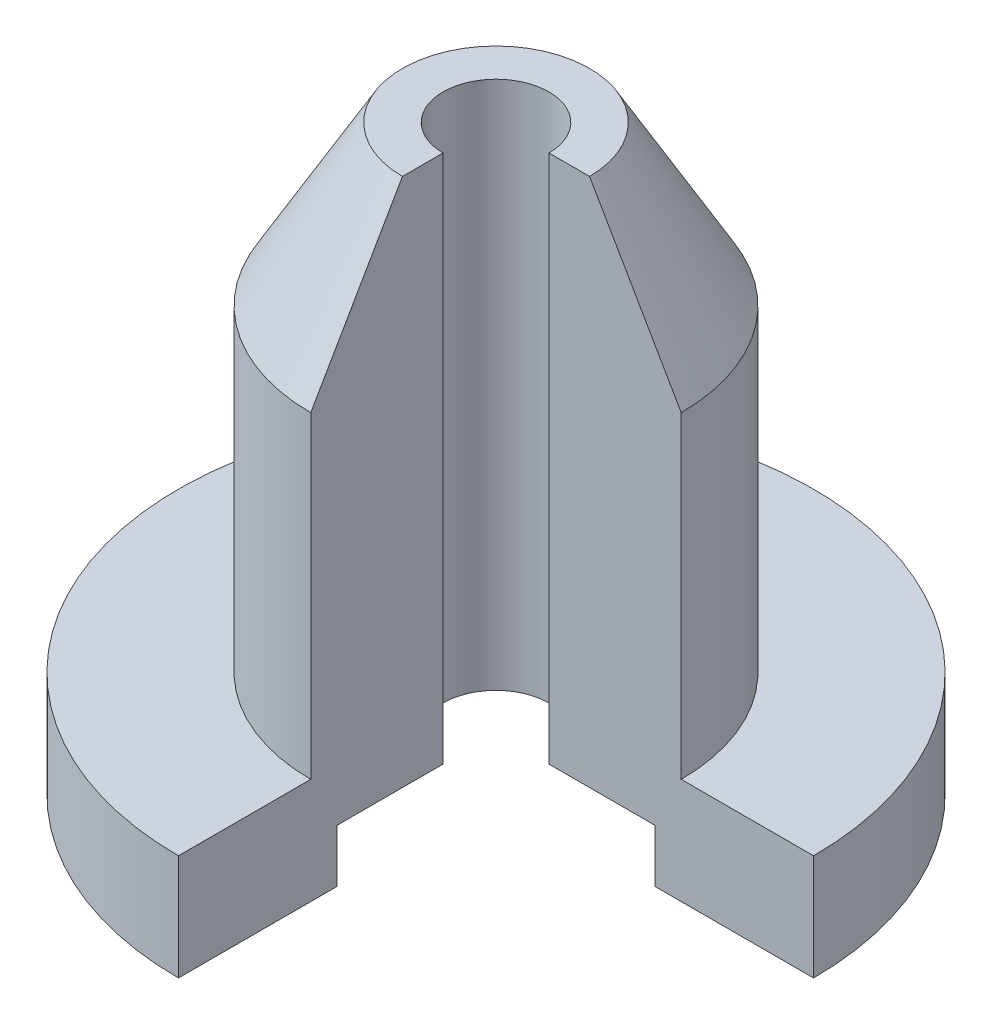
from build123d import *

# Parameters (mm, degrees)
REVOLVE1_ANGLE = 270


with BuildPart() as part:
    # Sketch1 → Revolve1 (revolve)
    with BuildSketch(Plane.XY):
        Polygon((15, 0), (15, 5), (5, 5), (5, 55), (8.839745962, 55), (17.5, 40), (17.5, 10), (30, 10), (30, 0), align=None)
    revolve(axis=Axis((0, 0, 0), (0, 1, 0)), revolution_arc=REVOLVE1_ANGLE)


solid = part.part
